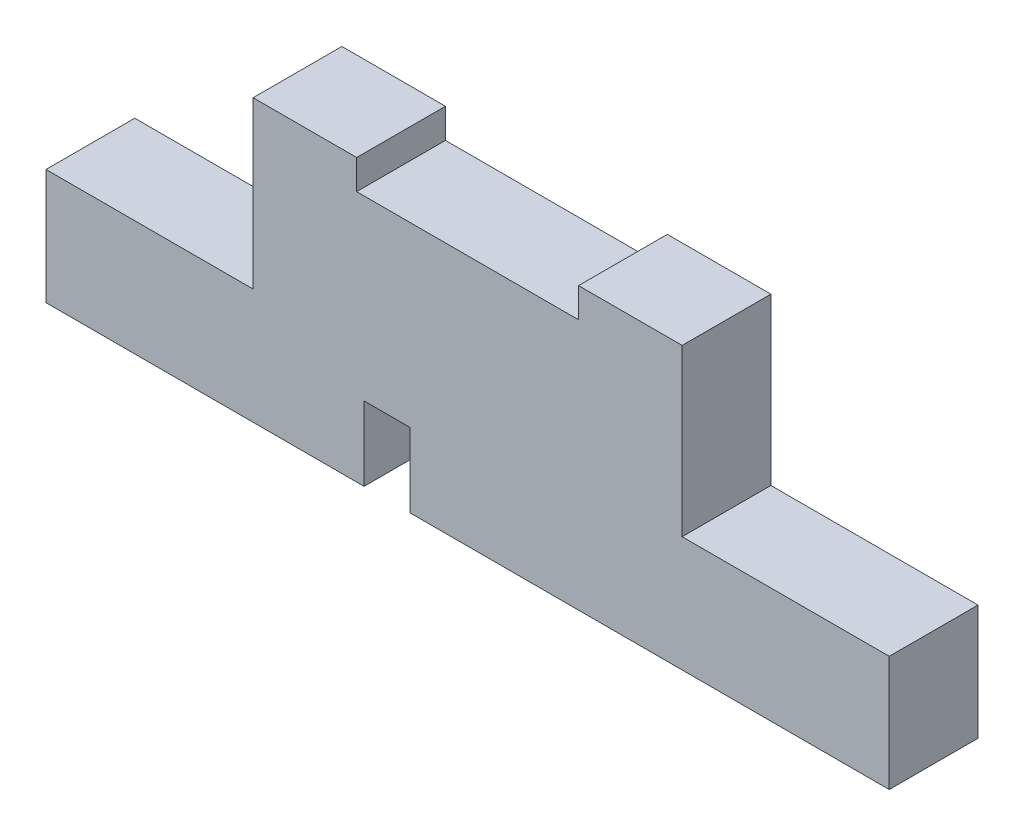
ISO-10303-21;
HEADER;
FILE_DESCRIPTION(('STEP AP214'),'2;1');
FILE_NAME('part.step','',(''),(''),'','','');
FILE_SCHEMA(('AUTOMOTIVE_DESIGN { 1 0 10303 214 1 1 1 1 }'));
ENDSEC;
DATA;
#1=APPLICATION_CONTEXT('core data for automotive mechanical design processes');
#2=APPLICATION_PROTOCOL_DEFINITION('international standard','automotive_design',2000,#1);
#3=PRODUCT_CONTEXT('',#1,'mechanical');
#4=PRODUCT('Part','Part','',(#3));
#5=PRODUCT_RELATED_PRODUCT_CATEGORY('part','',(#4));
#6=PRODUCT_DEFINITION_FORMATION('','',#4);
#7=PRODUCT_DEFINITION_CONTEXT('part definition',#1,'design');
#8=PRODUCT_DEFINITION('design','',#6,#7);
#9=PRODUCT_DEFINITION_SHAPE('','',#8);
#10=(LENGTH_UNIT() NAMED_UNIT(*) SI_UNIT(.MILLI.,.METRE.));
#11=(NAMED_UNIT(*) PLANE_ANGLE_UNIT() SI_UNIT($,.RADIAN.));
#12=(NAMED_UNIT(*) SI_UNIT($,.STERADIAN.) SOLID_ANGLE_UNIT());
#13=UNCERTAINTY_MEASURE_WITH_UNIT(LENGTH_MEASURE(1.E-05),#10,'distance_accuracy_value','');
#14=(GEOMETRIC_REPRESENTATION_CONTEXT(3) GLOBAL_UNCERTAINTY_ASSIGNED_CONTEXT((#13)) GLOBAL_UNIT_ASSIGNED_CONTEXT((#10,
#11,#12)) REPRESENTATION_CONTEXT('',''));
#15=CARTESIAN_POINT('',(0.,0.,0.));
#16=DIRECTION('',(0.,0.,1.));
#17=DIRECTION('',(1.,0.,0.));
#18=AXIS2_PLACEMENT_3D('',#15,#16,#17);
#19=CARTESIAN_POINT('',(21.5,19.,6.));
#20=DIRECTION('',(0.,-1.,0.));
#21=DIRECTION('',(1.,0.,0.));
#22=AXIS2_PLACEMENT_3D('',#19,#20,#21);
#23=PLANE('',#22);
#24=DIRECTION('',(-1.,0.,0.));
#25=VECTOR('',#24,1.);
#26=CARTESIAN_POINT('',(21.5,19.,0.));
#27=LINE('',#26,#25);
#28=CARTESIAN_POINT('',(21.5,19.,0.));
#29=VERTEX_POINT('',#28);
#30=CARTESIAN_POINT('',(14.5,19.,0.));
#31=VERTEX_POINT('',#30);
#32=EDGE_CURVE('E194',#29,#31,#27,.T.);
#33=ORIENTED_EDGE('',*,*,#32,.T.);
#34=DIRECTION('',(0.,0.,1.));
#35=VECTOR('',#34,1.);
#36=CARTESIAN_POINT('',(14.5,19.,6.));
#37=LINE('',#36,#35);
#38=CARTESIAN_POINT('',(14.5,19.,6.));
#39=VERTEX_POINT('',#38);
#40=EDGE_CURVE('E178',#31,#39,#37,.T.);
#41=ORIENTED_EDGE('',*,*,#40,.T.);
#42=DIRECTION('',(-1.,0.,0.));
#43=VECTOR('',#42,1.);
#44=CARTESIAN_POINT('',(21.5,19.,6.));
#45=LINE('',#44,#43);
#46=CARTESIAN_POINT('',(21.5,19.,6.));
#47=VERTEX_POINT('',#46);
#48=EDGE_CURVE('E154',#47,#39,#45,.T.);
#49=ORIENTED_EDGE('',*,*,#48,.F.);
#50=DIRECTION('',(0.,0.,-1.));
#51=VECTOR('',#50,1.);
#52=CARTESIAN_POINT('',(21.5,19.,6.));
#53=LINE('',#52,#51);
#54=EDGE_CURVE('E164',#47,#29,#53,.T.);
#55=ORIENTED_EDGE('',*,*,#54,.T.);
#56=EDGE_LOOP('',(#33,#41,#49,#55));
#57=FACE_BOUND('',#56,.T.);
#58=ADVANCED_FACE('F35',(#57),#23,.F.);
#59=CARTESIAN_POINT('',(-21.5,7.8,6.));
#60=DIRECTION('',(1.,0.,0.));
#61=DIRECTION('',(0.,0.,-1.));
#62=AXIS2_PLACEMENT_3D('',#59,#60,#61);
#63=PLANE('',#62);
#64=DIRECTION('',(0.,-1.,0.));
#65=VECTOR('',#64,1.);
#66=CARTESIAN_POINT('',(-21.5,7.8,0.));
#67=LINE('',#66,#65);
#68=CARTESIAN_POINT('',(-21.5,7.8,0.));
#69=VERTEX_POINT('',#68);
#70=CARTESIAN_POINT('',(-21.5,0.,0.));
#71=VERTEX_POINT('',#70);
#72=EDGE_CURVE('E174',#69,#71,#67,.T.);
#73=ORIENTED_EDGE('',*,*,#72,.T.);
#74=DIRECTION('',(0.,0.,-1.));
#75=VECTOR('',#74,1.);
#76=CARTESIAN_POINT('',(-21.5,0.,6.));
#77=LINE('',#76,#75);
#78=CARTESIAN_POINT('',(-21.5,0.,6.));
#79=VERTEX_POINT('',#78);
#80=EDGE_CURVE('E43',#79,#71,#77,.T.);
#81=ORIENTED_EDGE('',*,*,#80,.F.);
#82=DIRECTION('',(0.,-1.,0.));
#83=VECTOR('',#82,1.);
#84=CARTESIAN_POINT('',(-21.5,7.8,6.));
#85=LINE('',#84,#83);
#86=CARTESIAN_POINT('',(-21.5,7.8,6.));
#87=VERTEX_POINT('',#86);
#88=EDGE_CURVE('E200',#87,#79,#85,.T.);
#89=ORIENTED_EDGE('',*,*,#88,.F.);
#90=DIRECTION('',(0.,0.,-1.));
#91=VECTOR('',#90,1.);
#92=CARTESIAN_POINT('',(-21.5,7.8,6.));
#93=LINE('',#92,#91);
#94=EDGE_CURVE('E169',#87,#69,#93,.T.);
#95=ORIENTED_EDGE('',*,*,#94,.T.);
#96=EDGE_LOOP('',(#73,#81,#89,#95));
#97=FACE_BOUND('',#96,.T.);
#98=ADVANCED_FACE('F37',(#97),#63,.F.);
#99=CARTESIAN_POINT('',(-21.5,0.,6.));
#100=DIRECTION('',(0.,1.,0.));
#101=DIRECTION('',(-1.,0.,0.));
#102=AXIS2_PLACEMENT_3D('',#99,#100,#101);
#103=PLANE('',#102);
#104=DIRECTION('',(1.,0.,0.));
#105=VECTOR('',#104,1.);
#106=CARTESIAN_POINT('',(-21.5,0.,0.));
#107=LINE('',#106,#105);
#108=CARTESIAN_POINT('',(0.,0.,0.));
#109=VERTEX_POINT('',#108);
#110=EDGE_CURVE('E177',#71,#109,#107,.T.);
#111=ORIENTED_EDGE('',*,*,#110,.T.);
#112=DIRECTION('',(0.,0.,-1.));
#113=VECTOR('',#112,1.);
#114=CARTESIAN_POINT('',(0.,0.,6.));
#115=LINE('',#114,#113);
#116=CARTESIAN_POINT('',(0.,0.,6.));
#117=VERTEX_POINT('',#116);
#118=EDGE_CURVE('E223',#117,#109,#115,.T.);
#119=ORIENTED_EDGE('',*,*,#118,.F.);
#120=DIRECTION('',(1.,0.,0.));
#121=VECTOR('',#120,1.);
#122=CARTESIAN_POINT('',(-21.5,0.,6.));
#123=LINE('',#122,#121);
#124=EDGE_CURVE('E113',#79,#117,#123,.T.);
#125=ORIENTED_EDGE('',*,*,#124,.F.);
#126=ORIENTED_EDGE('',*,*,#80,.T.);
#127=EDGE_LOOP('',(#111,#119,#125,#126));
#128=FACE_BOUND('',#127,.T.);
#129=ADVANCED_FACE('F226',(#128),#103,.F.);
#130=CARTESIAN_POINT('',(0.,0.,6.));
#131=DIRECTION('',(-1.,0.,0.));
#132=DIRECTION('',(0.,-1.,0.));
#133=AXIS2_PLACEMENT_3D('',#130,#131,#132);
#134=PLANE('',#133);
#135=DIRECTION('',(0.,1.,0.));
#136=VECTOR('',#135,1.);
#137=CARTESIAN_POINT('',(0.,0.,0.));
#138=LINE('',#137,#136);
#139=CARTESIAN_POINT('',(0.,5.,0.));
#140=VERTEX_POINT('',#139);
#141=EDGE_CURVE('E180',#109,#140,#138,.T.);
#142=ORIENTED_EDGE('',*,*,#141,.T.);
#143=DIRECTION('',(0.,0.,-1.));
#144=VECTOR('',#143,1.);
#145=CARTESIAN_POINT('',(0.,5.,6.));
#146=LINE('',#145,#144);
#147=CARTESIAN_POINT('',(0.,5.,6.));
#148=VERTEX_POINT('',#147);
#149=EDGE_CURVE('E220',#148,#140,#146,.T.);
#150=ORIENTED_EDGE('',*,*,#149,.F.);
#151=DIRECTION('',(0.,1.,0.));
#152=VECTOR('',#151,1.);
#153=CARTESIAN_POINT('',(0.,0.,6.));
#154=LINE('',#153,#152);
#155=EDGE_CURVE('E246',#117,#148,#154,.T.);
#156=ORIENTED_EDGE('',*,*,#155,.F.);
#157=ORIENTED_EDGE('',*,*,#118,.T.);
#158=EDGE_LOOP('',(#142,#150,#156,#157));
#159=FACE_BOUND('',#158,.T.);
#160=ADVANCED_FACE('F237',(#159),#134,.F.);
#161=CARTESIAN_POINT('',(0.,5.,6.));
#162=DIRECTION('',(0.,1.,0.));
#163=DIRECTION('',(0.,0.,1.));
#164=AXIS2_PLACEMENT_3D('',#161,#162,#163);
#165=PLANE('',#164);
#166=DIRECTION('',(1.,0.,0.));
#167=VECTOR('',#166,1.);
#168=CARTESIAN_POINT('',(0.,5.,0.));
#169=LINE('',#168,#167);
#170=CARTESIAN_POINT('',(3.1,5.,0.));
#171=VERTEX_POINT('',#170);
#172=EDGE_CURVE('E182',#140,#171,#169,.T.);
#173=ORIENTED_EDGE('',*,*,#172,.T.);
#174=DIRECTION('',(0.,0.,-1.));
#175=VECTOR('',#174,1.);
#176=CARTESIAN_POINT('',(3.1,5.,6.));
#177=LINE('',#176,#175);
#178=CARTESIAN_POINT('',(3.1,5.,6.));
#179=VERTEX_POINT('',#178);
#180=EDGE_CURVE('E217',#179,#171,#177,.T.);
#181=ORIENTED_EDGE('',*,*,#180,.F.);
#182=DIRECTION('',(1.,0.,0.));
#183=VECTOR('',#182,1.);
#184=CARTESIAN_POINT('',(0.,5.,6.));
#185=LINE('',#184,#183);
#186=EDGE_CURVE('E243',#148,#179,#185,.T.);
#187=ORIENTED_EDGE('',*,*,#186,.F.);
#188=ORIENTED_EDGE('',*,*,#149,.T.);
#189=EDGE_LOOP('',(#173,#181,#187,#188));
#190=FACE_BOUND('',#189,.T.);
#191=ADVANCED_FACE('F241',(#190),#165,.F.);
#192=CARTESIAN_POINT('',(3.1,5.,6.));
#193=DIRECTION('',(1.,0.,0.));
#194=DIRECTION('',(0.,1.,0.));
#195=AXIS2_PLACEMENT_3D('',#192,#193,#194);
#196=PLANE('',#195);
#197=DIRECTION('',(0.,-1.,0.));
#198=VECTOR('',#197,1.);
#199=CARTESIAN_POINT('',(3.1,5.,0.));
#200=LINE('',#199,#198);
#201=CARTESIAN_POINT('',(3.1,0.,0.));
#202=VERTEX_POINT('',#201);
#203=EDGE_CURVE('E184',#171,#202,#200,.T.);
#204=ORIENTED_EDGE('',*,*,#203,.T.);
#205=DIRECTION('',(0.,0.,-1.));
#206=VECTOR('',#205,1.);
#207=CARTESIAN_POINT('',(3.1,0.,6.));
#208=LINE('',#207,#206);
#209=CARTESIAN_POINT('',(3.1,0.,6.));
#210=VERTEX_POINT('',#209);
#211=EDGE_CURVE('E214',#210,#202,#208,.T.);
#212=ORIENTED_EDGE('',*,*,#211,.F.);
#213=DIRECTION('',(0.,-1.,0.));
#214=VECTOR('',#213,1.);
#215=CARTESIAN_POINT('',(3.1,5.,6.));
#216=LINE('',#215,#214);
#217=EDGE_CURVE('E245',#179,#210,#216,.T.);
#218=ORIENTED_EDGE('',*,*,#217,.F.);
#219=ORIENTED_EDGE('',*,*,#180,.T.);
#220=EDGE_LOOP('',(#204,#212,#218,#219));
#221=FACE_BOUND('',#220,.T.);
#222=ADVANCED_FACE('F340',(#221),#196,.F.);
#223=CARTESIAN_POINT('',(35.5,0.,6.));
#224=DIRECTION('',(0.,1.,0.));
#225=DIRECTION('',(0.,0.,1.));
#226=AXIS2_PLACEMENT_3D('',#223,#224,#225);
#227=PLANE('',#226);
#228=DIRECTION('',(1.,0.,0.));
#229=VECTOR('',#228,1.);
#230=CARTESIAN_POINT('',(35.5,0.,0.));
#231=LINE('',#230,#229);
#232=CARTESIAN_POINT('',(35.5,0.,0.));
#233=VERTEX_POINT('',#232);
#234=EDGE_CURVE('E186',#202,#233,#231,.T.);
#235=ORIENTED_EDGE('',*,*,#234,.T.);
#236=DIRECTION('',(0.,0.,-1.));
#237=VECTOR('',#236,1.);
#238=CARTESIAN_POINT('',(35.5,0.,6.));
#239=LINE('',#238,#237);
#240=CARTESIAN_POINT('',(35.5,0.,6.));
#241=VERTEX_POINT('',#240);
#242=EDGE_CURVE('E211',#241,#233,#239,.T.);
#243=ORIENTED_EDGE('',*,*,#242,.F.);
#244=DIRECTION('',(1.,0.,0.));
#245=VECTOR('',#244,1.);
#246=CARTESIAN_POINT('',(35.5,0.,6.));
#247=LINE('',#246,#245);
#248=EDGE_CURVE('E248',#210,#241,#247,.T.);
#249=ORIENTED_EDGE('',*,*,#248,.F.);
#250=ORIENTED_EDGE('',*,*,#211,.T.);
#251=EDGE_LOOP('',(#235,#243,#249,#250));
#252=FACE_BOUND('',#251,.T.);
#253=ADVANCED_FACE('F336',(#252),#227,.F.);
#254=CARTESIAN_POINT('',(35.5,0.,6.));
#255=DIRECTION('',(-1.,0.,0.));
#256=DIRECTION('',(0.,-1.,0.));
#257=AXIS2_PLACEMENT_3D('',#254,#255,#256);
#258=PLANE('',#257);
#259=DIRECTION('',(0.,1.,0.));
#260=VECTOR('',#259,1.);
#261=CARTESIAN_POINT('',(35.5,0.,0.));
#262=LINE('',#261,#260);
#263=CARTESIAN_POINT('',(35.5,7.8,0.));
#264=VERTEX_POINT('',#263);
#265=EDGE_CURVE('E188',#233,#264,#262,.T.);
#266=ORIENTED_EDGE('',*,*,#265,.T.);
#267=DIRECTION('',(0.,0.,-1.));
#268=VECTOR('',#267,1.);
#269=CARTESIAN_POINT('',(35.5,7.8,6.));
#270=LINE('',#269,#268);
#271=CARTESIAN_POINT('',(35.5,7.8,6.));
#272=VERTEX_POINT('',#271);
#273=EDGE_CURVE('E208',#272,#264,#270,.T.);
#274=ORIENTED_EDGE('',*,*,#273,.F.);
#275=DIRECTION('',(0.,1.,0.));
#276=VECTOR('',#275,1.);
#277=CARTESIAN_POINT('',(35.5,0.,6.));
#278=LINE('',#277,#276);
#279=EDGE_CURVE('E254',#241,#272,#278,.T.);
#280=ORIENTED_EDGE('',*,*,#279,.F.);
#281=ORIENTED_EDGE('',*,*,#242,.T.);
#282=EDGE_LOOP('',(#266,#274,#280,#281));
#283=FACE_BOUND('',#282,.T.);
#284=ADVANCED_FACE('F330',(#283),#258,.F.);
#285=CARTESIAN_POINT('',(35.5,7.8,6.));
#286=DIRECTION('',(0.,-1.,0.));
#287=DIRECTION('',(0.,0.,-1.));
#288=AXIS2_PLACEMENT_3D('',#285,#286,#287);
#289=PLANE('',#288);
#290=DIRECTION('',(-1.,0.,0.));
#291=VECTOR('',#290,1.);
#292=CARTESIAN_POINT('',(35.5,7.8,0.));
#293=LINE('',#292,#291);
#294=CARTESIAN_POINT('',(21.5,7.8,0.));
#295=VERTEX_POINT('',#294);
#296=EDGE_CURVE('E190',#264,#295,#293,.T.);
#297=ORIENTED_EDGE('',*,*,#296,.T.);
#298=DIRECTION('',(0.,0.,-1.));
#299=VECTOR('',#298,1.);
#300=CARTESIAN_POINT('',(21.5,7.8,6.));
#301=LINE('',#300,#299);
#302=CARTESIAN_POINT('',(21.5,7.8,6.));
#303=VERTEX_POINT('',#302);
#304=EDGE_CURVE('E205',#303,#295,#301,.T.);
#305=ORIENTED_EDGE('',*,*,#304,.F.);
#306=DIRECTION('',(-1.,0.,0.));
#307=VECTOR('',#306,1.);
#308=CARTESIAN_POINT('',(35.5,7.8,6.));
#309=LINE('',#308,#307);
#310=EDGE_CURVE('E256',#272,#303,#309,.T.);
#311=ORIENTED_EDGE('',*,*,#310,.F.);
#312=ORIENTED_EDGE('',*,*,#273,.T.);
#313=EDGE_LOOP('',(#297,#305,#311,#312));
#314=FACE_BOUND('',#313,.T.);
#315=ADVANCED_FACE('F326',(#314),#289,.F.);
#316=CARTESIAN_POINT('',(21.5,7.8,6.));
#317=DIRECTION('',(-1.,0.,0.));
#318=DIRECTION('',(0.,-1.,0.));
#319=AXIS2_PLACEMENT_3D('',#316,#317,#318);
#320=PLANE('',#319);
#321=DIRECTION('',(0.,1.,0.));
#322=VECTOR('',#321,1.);
#323=CARTESIAN_POINT('',(21.5,7.8,0.));
#324=LINE('',#323,#322);
#325=EDGE_CURVE('E192',#295,#29,#324,.T.);
#326=ORIENTED_EDGE('',*,*,#325,.T.);
#327=ORIENTED_EDGE('',*,*,#54,.F.);
#328=DIRECTION('',(0.,1.,0.));
#329=VECTOR('',#328,1.);
#330=CARTESIAN_POINT('',(21.5,7.8,6.));
#331=LINE('',#330,#329);
#332=EDGE_CURVE('E155',#303,#47,#331,.T.);
#333=ORIENTED_EDGE('',*,*,#332,.F.);
#334=ORIENTED_EDGE('',*,*,#304,.T.);
#335=EDGE_LOOP('',(#326,#327,#333,#334));
#336=FACE_BOUND('',#335,.T.);
#337=ADVANCED_FACE('F264',(#336),#320,.F.);
#338=CARTESIAN_POINT('',(-0.500000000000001,19.,6.));
#339=VERTEX_POINT('',#338);
#340=CARTESIAN_POINT('',(-7.50000000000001,19.,6.));
#341=VERTEX_POINT('',#340);
#342=EDGE_CURVE('E141',#339,#341,#45,.T.);
#343=ORIENTED_EDGE('',*,*,#342,.F.);
#344=DIRECTION('',(0.,0.,-1.));
#345=VECTOR('',#344,1.);
#346=CARTESIAN_POINT('',(-0.5,19.,6.));
#347=LINE('',#346,#345);
#348=CARTESIAN_POINT('',(-0.500000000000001,19.,0.));
#349=VERTEX_POINT('',#348);
#350=EDGE_CURVE('E275',#339,#349,#347,.T.);
#351=ORIENTED_EDGE('',*,*,#350,.T.);
#352=CARTESIAN_POINT('',(-7.50000000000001,19.,0.));
#353=VERTEX_POINT('',#352);
#354=EDGE_CURVE('E161',#349,#353,#27,.T.);
#355=ORIENTED_EDGE('',*,*,#354,.T.);
#356=DIRECTION('',(0.,0.,-1.));
#357=VECTOR('',#356,1.);
#358=CARTESIAN_POINT('',(-7.50000000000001,19.,6.));
#359=LINE('',#358,#357);
#360=EDGE_CURVE('E158',#341,#353,#359,.T.);
#361=ORIENTED_EDGE('',*,*,#360,.F.);
#362=EDGE_LOOP('',(#343,#351,#355,#361));
#363=FACE_BOUND('',#362,.T.);
#364=ADVANCED_FACE('F159',(#363),#23,.F.);
#365=CARTESIAN_POINT('',(-7.50000000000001,19.,6.));
#366=DIRECTION('',(1.,0.,0.));
#367=DIRECTION('',(0.,1.,0.));
#368=AXIS2_PLACEMENT_3D('',#365,#366,#367);
#369=PLANE('',#368);
#370=DIRECTION('',(0.,-1.,0.));
#371=VECTOR('',#370,1.);
#372=CARTESIAN_POINT('',(-7.50000000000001,19.,0.));
#373=LINE('',#372,#371);
#374=CARTESIAN_POINT('',(-7.5,7.8,0.));
#375=VERTEX_POINT('',#374);
#376=EDGE_CURVE('E197',#353,#375,#373,.T.);
#377=ORIENTED_EDGE('',*,*,#376,.T.);
#378=DIRECTION('',(0.,0.,-1.));
#379=VECTOR('',#378,1.);
#380=CARTESIAN_POINT('',(-7.5,7.8,6.));
#381=LINE('',#380,#379);
#382=CARTESIAN_POINT('',(-7.5,7.8,6.));
#383=VERTEX_POINT('',#382);
#384=EDGE_CURVE('E165',#383,#375,#381,.T.);
#385=ORIENTED_EDGE('',*,*,#384,.F.);
#386=DIRECTION('',(0.,-1.,0.));
#387=VECTOR('',#386,1.);
#388=CARTESIAN_POINT('',(-7.50000000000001,19.,6.));
#389=LINE('',#388,#387);
#390=EDGE_CURVE('E146',#341,#383,#389,.T.);
#391=ORIENTED_EDGE('',*,*,#390,.F.);
#392=ORIENTED_EDGE('',*,*,#360,.T.);
#393=EDGE_LOOP('',(#377,#385,#391,#392));
#394=FACE_BOUND('',#393,.T.);
#395=ADVANCED_FACE('F167',(#394),#369,.F.);
#396=CARTESIAN_POINT('',(-7.5,7.8,6.));
#397=DIRECTION('',(0.,-1.,0.));
#398=DIRECTION('',(0.,0.,-1.));
#399=AXIS2_PLACEMENT_3D('',#396,#397,#398);
#400=PLANE('',#399);
#401=DIRECTION('',(-1.,0.,0.));
#402=VECTOR('',#401,1.);
#403=CARTESIAN_POINT('',(-7.5,7.8,0.));
#404=LINE('',#403,#402);
#405=EDGE_CURVE('E104',#375,#69,#404,.T.);
#406=ORIENTED_EDGE('',*,*,#405,.T.);
#407=ORIENTED_EDGE('',*,*,#94,.F.);
#408=DIRECTION('',(-1.,0.,0.));
#409=VECTOR('',#408,1.);
#410=CARTESIAN_POINT('',(-7.5,7.8,6.));
#411=LINE('',#410,#409);
#412=EDGE_CURVE('E59',#383,#87,#411,.T.);
#413=ORIENTED_EDGE('',*,*,#412,.F.);
#414=ORIENTED_EDGE('',*,*,#384,.T.);
#415=EDGE_LOOP('',(#406,#407,#413,#414));
#416=FACE_BOUND('',#415,.T.);
#417=ADVANCED_FACE('F306',(#416),#400,.F.);
#418=CARTESIAN_POINT('',(0.,0.,6.));
#419=DIRECTION('',(0.,0.,1.));
#420=DIRECTION('',(1.,0.,0.));
#421=AXIS2_PLACEMENT_3D('',#418,#419,#420);
#422=PLANE('',#421);
#423=DIRECTION('',(0.,1.,0.));
#424=VECTOR('',#423,1.);
#425=CARTESIAN_POINT('',(14.5,21.,6.));
#426=LINE('',#425,#424);
#427=CARTESIAN_POINT('',(14.5,17.,6.));
#428=VERTEX_POINT('',#427);
#429=EDGE_CURVE('E290',#428,#39,#426,.T.);
#430=ORIENTED_EDGE('',*,*,#429,.F.);
#431=DIRECTION('',(1.,0.,0.));
#432=VECTOR('',#431,1.);
#433=CARTESIAN_POINT('',(-0.500000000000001,17.,6.));
#434=LINE('',#433,#432);
#435=CARTESIAN_POINT('',(-0.500000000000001,17.,6.));
#436=VERTEX_POINT('',#435);
#437=EDGE_CURVE('E285',#436,#428,#434,.T.);
#438=ORIENTED_EDGE('',*,*,#437,.F.);
#439=DIRECTION('',(0.,-1.,0.));
#440=VECTOR('',#439,1.);
#441=CARTESIAN_POINT('',(-0.500000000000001,21.,6.));
#442=LINE('',#441,#440);
#443=EDGE_CURVE('E151',#339,#436,#442,.T.);
#444=ORIENTED_EDGE('',*,*,#443,.F.);
#445=ORIENTED_EDGE('',*,*,#342,.T.);
#446=ORIENTED_EDGE('',*,*,#390,.T.);
#447=ORIENTED_EDGE('',*,*,#412,.T.);
#448=ORIENTED_EDGE('',*,*,#88,.T.);
#449=ORIENTED_EDGE('',*,*,#124,.T.);
#450=ORIENTED_EDGE('',*,*,#155,.T.);
#451=ORIENTED_EDGE('',*,*,#186,.T.);
#452=ORIENTED_EDGE('',*,*,#217,.T.);
#453=ORIENTED_EDGE('',*,*,#248,.T.);
#454=ORIENTED_EDGE('',*,*,#279,.T.);
#455=ORIENTED_EDGE('',*,*,#310,.T.);
#456=ORIENTED_EDGE('',*,*,#332,.T.);
#457=ORIENTED_EDGE('',*,*,#48,.T.);
#458=EDGE_LOOP('',(#430,#438,#444,#445,#446,#447,#448,#449,#450,#451,#452,#453,#454,#455,#456,#457));
#459=FACE_BOUND('',#458,.T.);
#460=ADVANCED_FACE('F144',(#459),#422,.T.);
#461=CARTESIAN_POINT('',(0.,0.,0.));
#462=DIRECTION('',(0.,0.,1.));
#463=DIRECTION('',(1.,0.,0.));
#464=AXIS2_PLACEMENT_3D('',#461,#462,#463);
#465=PLANE('',#464);
#466=DIRECTION('',(1.,0.,0.));
#467=VECTOR('',#466,1.);
#468=CARTESIAN_POINT('',(-0.500000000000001,17.,0.));
#469=LINE('',#468,#467);
#470=CARTESIAN_POINT('',(-0.500000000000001,17.,0.));
#471=VERTEX_POINT('',#470);
#472=CARTESIAN_POINT('',(14.5,17.,0.));
#473=VERTEX_POINT('',#472);
#474=EDGE_CURVE('E50',#471,#473,#469,.T.);
#475=ORIENTED_EDGE('',*,*,#474,.T.);
#476=DIRECTION('',(0.,1.,0.));
#477=VECTOR('',#476,1.);
#478=CARTESIAN_POINT('',(14.5,21.,0.));
#479=LINE('',#478,#477);
#480=EDGE_CURVE('E288',#473,#31,#479,.T.);
#481=ORIENTED_EDGE('',*,*,#480,.T.);
#482=ORIENTED_EDGE('',*,*,#32,.F.);
#483=ORIENTED_EDGE('',*,*,#325,.F.);
#484=ORIENTED_EDGE('',*,*,#296,.F.);
#485=ORIENTED_EDGE('',*,*,#265,.F.);
#486=ORIENTED_EDGE('',*,*,#234,.F.);
#487=ORIENTED_EDGE('',*,*,#203,.F.);
#488=ORIENTED_EDGE('',*,*,#172,.F.);
#489=ORIENTED_EDGE('',*,*,#141,.F.);
#490=ORIENTED_EDGE('',*,*,#110,.F.);
#491=ORIENTED_EDGE('',*,*,#72,.F.);
#492=ORIENTED_EDGE('',*,*,#405,.F.);
#493=ORIENTED_EDGE('',*,*,#376,.F.);
#494=ORIENTED_EDGE('',*,*,#354,.F.);
#495=DIRECTION('',(0.,-1.,0.));
#496=VECTOR('',#495,1.);
#497=CARTESIAN_POINT('',(-0.499999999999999,0.,0.));
#498=LINE('',#497,#496);
#499=EDGE_CURVE('E11',#349,#471,#498,.T.);
#500=ORIENTED_EDGE('',*,*,#499,.T.);
#501=EDGE_LOOP('',(#475,#481,#482,#483,#484,#485,#486,#487,#488,#489,#490,#491,#492,#493,#494,#500));
#502=FACE_BOUND('',#501,.T.);
#503=ADVANCED_FACE('F231',(#502),#465,.F.);
#504=CARTESIAN_POINT('',(14.5,21.,0.));
#505=DIRECTION('',(1.,0.,0.));
#506=DIRECTION('',(0.,0.,-1.));
#507=AXIS2_PLACEMENT_3D('',#504,#505,#506);
#508=PLANE('',#507);
#509=ORIENTED_EDGE('',*,*,#480,.F.);
#510=DIRECTION('',(0.,0.,1.));
#511=VECTOR('',#510,1.);
#512=CARTESIAN_POINT('',(14.5,17.,0.));
#513=LINE('',#512,#511);
#514=EDGE_CURVE('E277',#473,#428,#513,.T.);
#515=ORIENTED_EDGE('',*,*,#514,.T.);
#516=ORIENTED_EDGE('',*,*,#429,.T.);
#517=ORIENTED_EDGE('',*,*,#40,.F.);
#518=EDGE_LOOP('',(#509,#515,#516,#517));
#519=FACE_BOUND('',#518,.T.);
#520=ADVANCED_FACE('F294',(#519),#508,.F.);
#521=CARTESIAN_POINT('',(-0.500000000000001,21.,0.));
#522=DIRECTION('',(-1.,0.,0.));
#523=DIRECTION('',(0.,-1.,0.));
#524=AXIS2_PLACEMENT_3D('',#521,#522,#523);
#525=PLANE('',#524);
#526=ORIENTED_EDGE('',*,*,#443,.T.);
#527=DIRECTION('',(0.,0.,1.));
#528=VECTOR('',#527,1.);
#529=CARTESIAN_POINT('',(-0.500000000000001,17.,0.));
#530=LINE('',#529,#528);
#531=EDGE_CURVE('E281',#471,#436,#530,.T.);
#532=ORIENTED_EDGE('',*,*,#531,.F.);
#533=ORIENTED_EDGE('',*,*,#499,.F.);
#534=ORIENTED_EDGE('',*,*,#350,.F.);
#535=EDGE_LOOP('',(#526,#532,#533,#534));
#536=FACE_BOUND('',#535,.T.);
#537=ADVANCED_FACE('F305',(#536),#525,.F.);
#538=CARTESIAN_POINT('',(-0.500000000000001,17.,0.));
#539=DIRECTION('',(0.,-1.,0.));
#540=DIRECTION('',(0.,0.,-1.));
#541=AXIS2_PLACEMENT_3D('',#538,#539,#540);
#542=PLANE('',#541);
#543=ORIENTED_EDGE('',*,*,#437,.T.);
#544=ORIENTED_EDGE('',*,*,#514,.F.);
#545=ORIENTED_EDGE('',*,*,#474,.F.);
#546=ORIENTED_EDGE('',*,*,#531,.T.);
#547=EDGE_LOOP('',(#543,#544,#545,#546));
#548=FACE_BOUND('',#547,.T.);
#549=ADVANCED_FACE('F429',(#548),#542,.F.);
#550=CLOSED_SHELL('',(#58,#98,#129,#160,#191,#222,#253,#284,#315,#337,#364,#395,#417,#460,#503,
#520,#537,#549));
#551=MANIFOLD_SOLID_BREP('B2',#550);
#552=ADVANCED_BREP_SHAPE_REPRESENTATION('',(#18,#551),#14);
#553=SHAPE_DEFINITION_REPRESENTATION(#9,#552);
ENDSEC;
END-ISO-10303-21;
